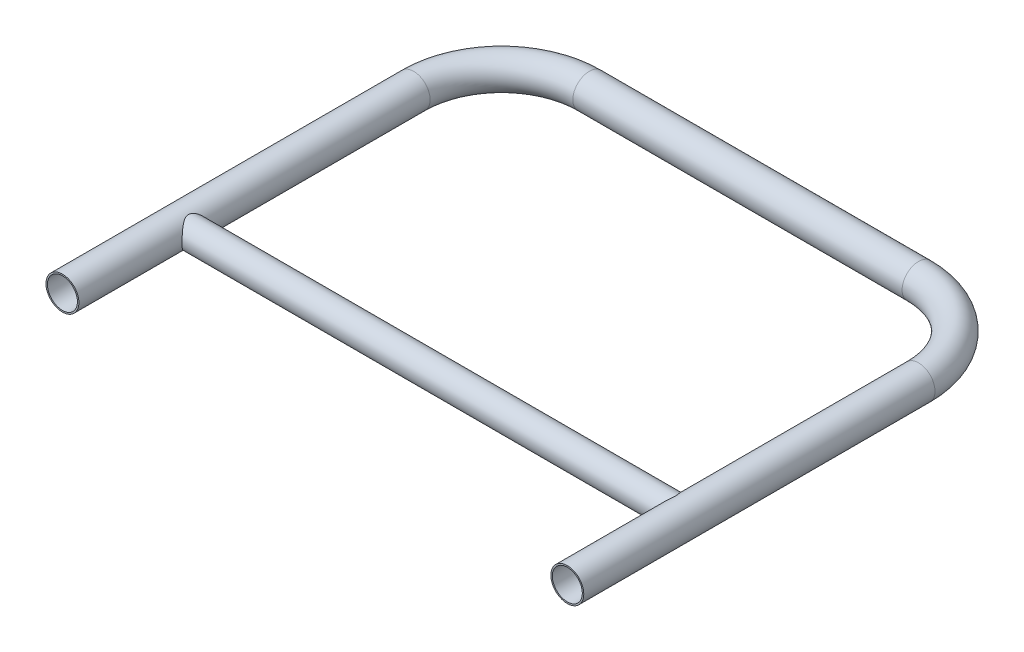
from build123d import *

# Parameters (mm, degrees)
ESQUISSE1_R                         = 22.5
ESQUISSE1_R_2                       = 20.5
EXTRU_MINCE1_REACH                  = 725.235
EXTRU_MINCE1_END_RADIUS             = 22.5
ESQUISSE3_R                         = 19
ESQUISSE3_R_2                       = 17.5
EXTRU_MINCE1_DIRECTION_2_REACH      = 725.235
EXTRU_MINCE1_DIRECTION_2_END_RADIUS = 22.5


with BuildPart() as part:
    # Balayage1: sweep along a path in Esquisse2
    with BuildLine(Plane(origin=(0, 0, 0), x_dir=(1, 0, 0), z_dir=(0, 1, 0))) as balayage1_path:
        Line((0, 0), (0, 480))
        ThreePointArc((0, 480), (35.147186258, 564.852813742), (120, 600))
        Line((120, 600), (570, 600))
        ThreePointArc((570, 600), (654.852813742, 564.852813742), (690, 480))
        Line((690, 480), (690, 0))
    # Esquisse1 → Balayage1 (sweep)
    with BuildSketch(Plane.XY):
        Circle(ESQUISSE1_R)
        Circle(ESQUISSE1_R_2, mode=Mode.SUBTRACT)
    sweep(path=balayage1_path.line)

    # Extru.-Mince1: up to this cylinder (the profile starts outside it)
    extru_mince1_end = Plane(origin=(690, 0, -141.537401), z_dir=(0, 0, 1)) * Cylinder(EXTRU_MINCE1_END_RADIUS, 1496.47, mode=Mode.PRIVATE)
    # Esquisse3 → Extru.-Mince1 (add, up to the surface)
    with BuildSketch(Plane(origin=(345, 0, 0), x_dir=(0, 0, -1), z_dir=(1, 0, 0)), mode=Mode.PRIVATE) as extru_mince1_sk1:
        with Locations((160, 0)):
            Circle(ESQUISSE3_R)
        with Locations((160, 0)):
            Circle(ESQUISSE3_R_2, mode=Mode.SUBTRACT)
    extru_mince1_tool1 = extrude(extru_mince1_sk1.sketch, amount=EXTRU_MINCE1_REACH, mode=Mode.PRIVATE) - extru_mince1_end
    add(extru_mince1_tool1.solids().sort_by_distance((345, 0, -141.537401))[0])

    # Extru.-Mince1 direction 2: up to this cylinder (the profile starts outside it)
    extru_mince1_direction_2_end = Plane(origin=(0, 0, -141.537401), z_dir=(0, 0, 1)) * Cylinder(EXTRU_MINCE1_DIRECTION_2_END_RADIUS, 1496.47, mode=Mode.PRIVATE)
    # Esquisse3 → Extru.-Mince1 direction 2 (add, up to the surface)
    with BuildSketch(Plane(origin=(345, 0, 0), x_dir=(0, 0, -1), z_dir=(1, 0, 0)), mode=Mode.PRIVATE) as extru_mince1_direction_2_sk1:
        with Locations((160, 0)):
            Circle(ESQUISSE3_R)
        with Locations((160, 0)):
            Circle(ESQUISSE3_R_2, mode=Mode.SUBTRACT)
    extru_mince1_direction_2_tool1 = extrude(extru_mince1_direction_2_sk1.sketch, amount=-EXTRU_MINCE1_DIRECTION_2_REACH, mode=Mode.PRIVATE) - extru_mince1_direction_2_end
    add(extru_mince1_direction_2_tool1.solids().sort_by_distance((345, 0, -141.537401))[0])


solid = part.part
